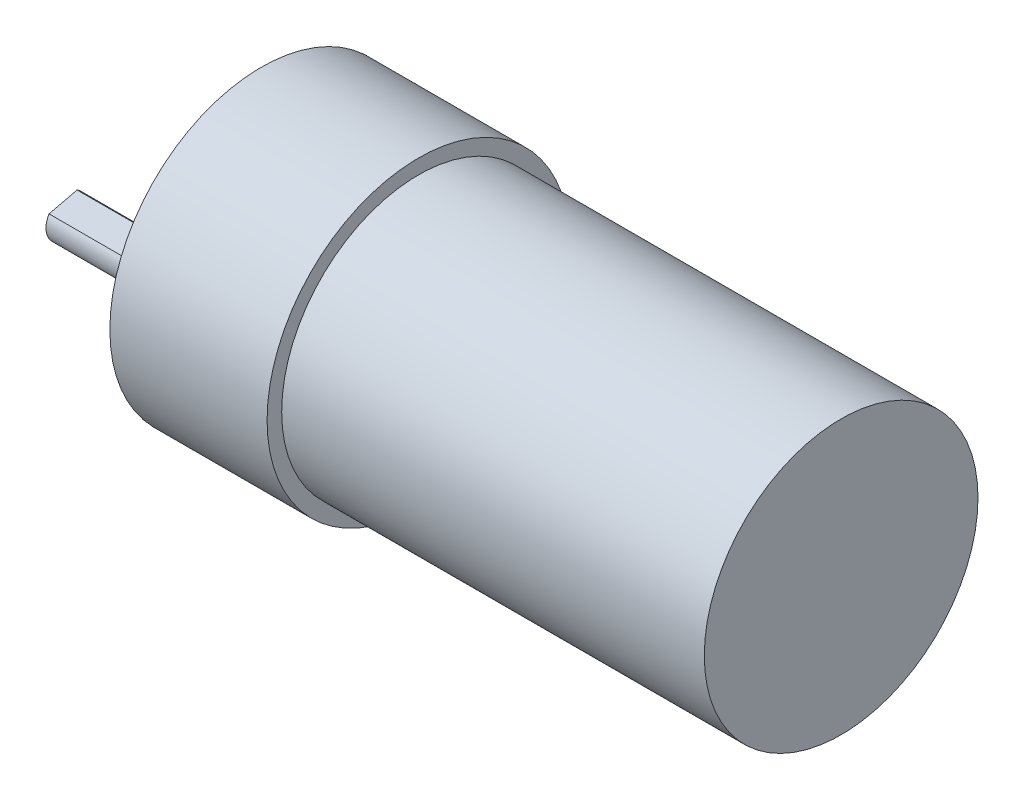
ISO-10303-21;
HEADER;
FILE_DESCRIPTION(('STEP AP214'),'2;1');
FILE_NAME('part.step','',(''),(''),'','','');
FILE_SCHEMA(('AUTOMOTIVE_DESIGN { 1 0 10303 214 1 1 1 1 }'));
ENDSEC;
DATA;
#1=APPLICATION_CONTEXT('core data for automotive mechanical design processes');
#2=APPLICATION_PROTOCOL_DEFINITION('international standard','automotive_design',2000,#1);
#3=PRODUCT_CONTEXT('',#1,'mechanical');
#4=PRODUCT('Part','Part','',(#3));
#5=PRODUCT_RELATED_PRODUCT_CATEGORY('part','',(#4));
#6=PRODUCT_DEFINITION_FORMATION('','',#4);
#7=PRODUCT_DEFINITION_CONTEXT('part definition',#1,'design');
#8=PRODUCT_DEFINITION('design','',#6,#7);
#9=PRODUCT_DEFINITION_SHAPE('','',#8);
#10=(LENGTH_UNIT() NAMED_UNIT(*) SI_UNIT(.MILLI.,.METRE.));
#11=(NAMED_UNIT(*) PLANE_ANGLE_UNIT() SI_UNIT($,.RADIAN.));
#12=(NAMED_UNIT(*) SI_UNIT($,.STERADIAN.) SOLID_ANGLE_UNIT());
#13=UNCERTAINTY_MEASURE_WITH_UNIT(LENGTH_MEASURE(1.E-05),#10,'distance_accuracy_value','');
#14=(GEOMETRIC_REPRESENTATION_CONTEXT(3) GLOBAL_UNCERTAINTY_ASSIGNED_CONTEXT((#13)) GLOBAL_UNIT_ASSIGNED_CONTEXT((#10,
#11,#12)) REPRESENTATION_CONTEXT('',''));
#15=CARTESIAN_POINT('',(0.,0.,0.));
#16=DIRECTION('',(0.,0.,1.));
#17=DIRECTION('',(1.,0.,0.));
#18=AXIS2_PLACEMENT_3D('',#15,#16,#17);
#19=CARTESIAN_POINT('',(-40.8432,-8.71855,0.));
#20=DIRECTION('',(1.,0.,0.));
#21=DIRECTION('',(0.,0.,-1.));
#22=AXIS2_PLACEMENT_3D('',#19,#20,#21);
#23=CYLINDRICAL_SURFACE('',#22,2.3749);
#24=CARTESIAN_POINT('',(-18.2372,-8.71855,0.));
#25=DIRECTION('',(-1.,0.,0.));
#26=DIRECTION('',(0.,0.,1.));
#27=AXIS2_PLACEMENT_3D('',#24,#25,#26);
#28=CIRCLE('',#27,2.3749);
#29=CARTESIAN_POINT('',(-18.2372,-8.71855,2.3749));
#30=VERTEX_POINT('',#29);
#31=EDGE_CURVE('E90',#30,#30,#28,.T.);
#32=ORIENTED_EDGE('',*,*,#31,.T.);
#33=EDGE_LOOP('',(#32));
#34=FACE_BOUND('',#33,.T.);
#35=DIRECTION('',(1.,0.,0.));
#36=VECTOR('',#35,1.);
#37=CARTESIAN_POINT('',(-40.8432,-6.68747817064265,-1.23081161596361));
#38=LINE('',#37,#36);
#39=CARTESIAN_POINT('',(-25.8572,-6.68747817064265,-1.23081161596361));
#40=VERTEX_POINT('',#39);
#41=CARTESIAN_POINT('',(-40.8432,-6.68747817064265,-1.23081161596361));
#42=VERTEX_POINT('',#41);
#43=EDGE_CURVE('E51',#40,#42,#38,.F.);
#44=ORIENTED_EDGE('',*,*,#43,.F.);
#45=CARTESIAN_POINT('',(-25.8572,-8.71855,0.));
#46=DIRECTION('',(1.,0.,0.));
#47=DIRECTION('',(0.,0.,-1.));
#48=AXIS2_PLACEMENT_3D('',#45,#46,#47);
#49=CIRCLE('',#48,2.3749);
#50=CARTESIAN_POINT('',(-25.8572,-7.46406700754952,2.01653723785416));
#51=VERTEX_POINT('',#50);
#52=EDGE_CURVE('E11',#40,#51,#49,.T.);
#53=ORIENTED_EDGE('',*,*,#52,.T.);
#54=DIRECTION('',(1.,0.,0.));
#55=VECTOR('',#54,1.);
#56=CARTESIAN_POINT('',(-40.8432,-7.46406700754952,2.01653723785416));
#57=LINE('',#56,#55);
#58=CARTESIAN_POINT('',(-40.8432,-7.46406700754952,2.01653723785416));
#59=VERTEX_POINT('',#58);
#60=EDGE_CURVE('E60',#59,#51,#57,.T.);
#61=ORIENTED_EDGE('',*,*,#60,.F.);
#62=CARTESIAN_POINT('',(-40.8432,-8.71855,0.));
#63=DIRECTION('',(-1.,0.,0.));
#64=DIRECTION('',(0.,0.,1.));
#65=AXIS2_PLACEMENT_3D('',#62,#63,#64);
#66=CIRCLE('',#65,2.3749);
#67=EDGE_CURVE('E72',#42,#59,#66,.T.);
#68=ORIENTED_EDGE('',*,*,#67,.F.);
#69=EDGE_LOOP('',(#44,#53,#61,#68));
#70=FACE_BOUND('',#69,.T.);
#71=ADVANCED_FACE('F36',(#34,#70),#23,.T.);
#72=CARTESIAN_POINT('',(-40.8432,-8.71855,0.));
#73=DIRECTION('',(-1.,0.,0.));
#74=DIRECTION('',(0.,0.,1.));
#75=AXIS2_PLACEMENT_3D('',#72,#73,#74);
#76=PLANE('',#75);
#77=ORIENTED_EDGE('',*,*,#67,.T.);
#78=DIRECTION('',(0.,0.232587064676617,-0.972575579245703));
#79=VECTOR('',#78,1.);
#80=CARTESIAN_POINT('',(-40.8432,-7.07577258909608,0.392862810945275));
#81=LINE('',#80,#79);
#82=EDGE_CURVE('E44',#59,#42,#81,.T.);
#83=ORIENTED_EDGE('',*,*,#82,.T.);
#84=EDGE_LOOP('',(#77,#83));
#85=FACE_BOUND('',#84,.T.);
#86=ADVANCED_FACE('F108',(#85),#76,.T.);
#87=CARTESIAN_POINT('',(-18.2372,0.,0.));
#88=DIRECTION('',(-1.,0.,0.));
#89=DIRECTION('',(0.,0.,1.));
#90=AXIS2_PLACEMENT_3D('',#87,#88,#89);
#91=PLANE('',#90);
#92=CARTESIAN_POINT('',(-18.2372,-8.71855,-10.2108));
#93=DIRECTION('',(-1.,0.,0.));
#94=DIRECTION('',(0.,0.,1.));
#95=AXIS2_PLACEMENT_3D('',#92,#93,#94);
#96=CIRCLE('',#95,1.27);
#97=CARTESIAN_POINT('',(-18.2372,-8.71855,-8.9408));
#98=VERTEX_POINT('',#97);
#99=EDGE_CURVE('E67',#98,#98,#96,.T.);
#100=ORIENTED_EDGE('',*,*,#99,.F.);
#101=EDGE_LOOP('',(#100));
#102=FACE_BOUND('',#101,.T.);
#103=CARTESIAN_POINT('',(-18.2372,-8.71855,10.2108));
#104=DIRECTION('',(-1.,0.,0.));
#105=DIRECTION('',(0.,0.,1.));
#106=AXIS2_PLACEMENT_3D('',#103,#104,#105);
#107=CIRCLE('',#106,1.27);
#108=CARTESIAN_POINT('',(-18.2372,-8.71855,11.4808));
#109=VERTEX_POINT('',#108);
#110=EDGE_CURVE('E78',#109,#109,#107,.T.);
#111=ORIENTED_EDGE('',*,*,#110,.F.);
#112=EDGE_LOOP('',(#111));
#113=FACE_BOUND('',#112,.T.);
#114=CARTESIAN_POINT('',(-18.2372,13.45565,0.));
#115=DIRECTION('',(-1.,0.,0.));
#116=DIRECTION('',(0.,0.,1.));
#117=AXIS2_PLACEMENT_3D('',#114,#115,#116);
#118=CIRCLE('',#117,1.27);
#119=CARTESIAN_POINT('',(-18.2372,13.45565,1.27));
#120=VERTEX_POINT('',#119);
#121=EDGE_CURVE('E84',#120,#120,#118,.T.);
#122=ORIENTED_EDGE('',*,*,#121,.F.);
#123=EDGE_LOOP('',(#122));
#124=FACE_BOUND('',#123,.T.);
#125=CARTESIAN_POINT('',(-18.2372,0.,0.));
#126=DIRECTION('',(-1.,0.,0.));
#127=DIRECTION('',(0.,0.,1.));
#128=AXIS2_PLACEMENT_3D('',#125,#126,#127);
#129=CIRCLE('',#128,17.56918);
#130=CARTESIAN_POINT('',(-18.2372,0.,17.56918));
#131=VERTEX_POINT('',#130);
#132=EDGE_CURVE('E97',#131,#131,#129,.T.);
#133=ORIENTED_EDGE('',*,*,#132,.T.);
#134=EDGE_LOOP('',(#133));
#135=FACE_BOUND('',#134,.T.);
#136=ORIENTED_EDGE('',*,*,#31,.F.);
#137=EDGE_LOOP('',(#136));
#138=FACE_BOUND('',#137,.T.);
#139=ADVANCED_FACE('F110',(#102,#113,#124,#135,#138),#91,.T.);
#140=CARTESIAN_POINT('',(49.022,0.,0.));
#141=DIRECTION('',(-1.,0.,0.));
#142=DIRECTION('',(0.,0.,1.));
#143=AXIS2_PLACEMENT_3D('',#140,#141,#142);
#144=CYLINDRICAL_SURFACE('',#143,15.875);
#145=CARTESIAN_POINT('',(49.022,0.,0.));
#146=DIRECTION('',(1.,0.,0.));
#147=DIRECTION('',(0.,0.,-1.));
#148=AXIS2_PLACEMENT_3D('',#145,#146,#147);
#149=CIRCLE('',#148,15.875);
#150=CARTESIAN_POINT('',(49.022,0.,-15.875));
#151=VERTEX_POINT('',#150);
#152=EDGE_CURVE('E105',#151,#151,#149,.T.);
#153=ORIENTED_EDGE('',*,*,#152,.F.);
#154=EDGE_LOOP('',(#153));
#155=FACE_BOUND('',#154,.T.);
#156=CARTESIAN_POINT('',(0.,0.,0.));
#157=DIRECTION('',(-1.,0.,0.));
#158=DIRECTION('',(0.,0.,1.));
#159=AXIS2_PLACEMENT_3D('',#156,#157,#158);
#160=CIRCLE('',#159,15.875);
#161=CARTESIAN_POINT('',(0.,0.,15.875));
#162=VERTEX_POINT('',#161);
#163=EDGE_CURVE('E100',#162,#162,#160,.T.);
#164=ORIENTED_EDGE('',*,*,#163,.F.);
#165=EDGE_LOOP('',(#164));
#166=FACE_BOUND('',#165,.T.);
#167=ADVANCED_FACE('F38',(#155,#166),#144,.T.);
#168=CARTESIAN_POINT('',(49.022,0.,0.));
#169=DIRECTION('',(1.,0.,0.));
#170=DIRECTION('',(0.,0.,-1.));
#171=AXIS2_PLACEMENT_3D('',#168,#169,#170);
#172=PLANE('',#171);
#173=ORIENTED_EDGE('',*,*,#152,.T.);
#174=EDGE_LOOP('',(#173));
#175=FACE_BOUND('',#174,.T.);
#176=ADVANCED_FACE('F128',(#175),#172,.T.);
#177=CARTESIAN_POINT('',(0.,0.,0.));
#178=DIRECTION('',(-1.,0.,0.));
#179=DIRECTION('',(0.,0.,1.));
#180=AXIS2_PLACEMENT_3D('',#177,#178,#179);
#181=PLANE('',#180);
#182=CARTESIAN_POINT('',(0.,0.,0.));
#183=DIRECTION('',(-1.,0.,0.));
#184=DIRECTION('',(0.,0.,1.));
#185=AXIS2_PLACEMENT_3D('',#182,#183,#184);
#186=CIRCLE('',#185,17.56918);
#187=CARTESIAN_POINT('',(0.,0.,17.56918));
#188=VERTEX_POINT('',#187);
#189=EDGE_CURVE('E94',#188,#188,#186,.T.);
#190=ORIENTED_EDGE('',*,*,#189,.F.);
#191=EDGE_LOOP('',(#190));
#192=FACE_BOUND('',#191,.T.);
#193=ORIENTED_EDGE('',*,*,#163,.T.);
#194=EDGE_LOOP('',(#193));
#195=FACE_BOUND('',#194,.T.);
#196=ADVANCED_FACE('F124',(#192,#195),#181,.F.);
#197=CARTESIAN_POINT('',(-18.2372,0.,0.));
#198=DIRECTION('',(1.,0.,0.));
#199=DIRECTION('',(0.,0.,-1.));
#200=AXIS2_PLACEMENT_3D('',#197,#198,#199);
#201=CYLINDRICAL_SURFACE('',#200,17.56918);
#202=ORIENTED_EDGE('',*,*,#132,.F.);
#203=EDGE_LOOP('',(#202));
#204=FACE_BOUND('',#203,.T.);
#205=ORIENTED_EDGE('',*,*,#189,.T.);
#206=EDGE_LOOP('',(#205));
#207=FACE_BOUND('',#206,.T.);
#208=ADVANCED_FACE('F127',(#204,#207),#201,.T.);
#209=CARTESIAN_POINT('',(-8.2372,13.45565,0.));
#210=DIRECTION('',(-1.,0.,0.));
#211=DIRECTION('',(0.,0.,1.));
#212=AXIS2_PLACEMENT_3D('',#209,#210,#211);
#213=CYLINDRICAL_SURFACE('',#212,1.27);
#214=CARTESIAN_POINT('',(-8.2372,13.45565,0.));
#215=DIRECTION('',(-1.,0.,0.));
#216=DIRECTION('',(0.,0.,1.));
#217=AXIS2_PLACEMENT_3D('',#214,#215,#216);
#218=CIRCLE('',#217,1.27);
#219=CARTESIAN_POINT('',(-8.2372,13.45565,1.27));
#220=VERTEX_POINT('',#219);
#221=EDGE_CURVE('E87',#220,#220,#218,.T.);
#222=ORIENTED_EDGE('',*,*,#221,.F.);
#223=EDGE_LOOP('',(#222));
#224=FACE_BOUND('',#223,.T.);
#225=ORIENTED_EDGE('',*,*,#121,.T.);
#226=EDGE_LOOP('',(#225));
#227=FACE_BOUND('',#226,.T.);
#228=ADVANCED_FACE('F121',(#224,#227),#213,.F.);
#229=CARTESIAN_POINT('',(-8.2372,13.45565,0.));
#230=DIRECTION('',(-1.,0.,0.));
#231=DIRECTION('',(0.,0.,1.));
#232=AXIS2_PLACEMENT_3D('',#229,#230,#231);
#233=PLANE('',#232);
#234=ORIENTED_EDGE('',*,*,#221,.T.);
#235=EDGE_LOOP('',(#234));
#236=FACE_BOUND('',#235,.T.);
#237=ADVANCED_FACE('F166',(#236),#233,.T.);
#238=CARTESIAN_POINT('',(-8.2372,-8.71855,10.2108));
#239=DIRECTION('',(-1.,0.,0.));
#240=DIRECTION('',(0.,0.,1.));
#241=AXIS2_PLACEMENT_3D('',#238,#239,#240);
#242=CYLINDRICAL_SURFACE('',#241,1.27);
#243=CARTESIAN_POINT('',(-8.2372,-8.71855,10.2108));
#244=DIRECTION('',(-1.,0.,0.));
#245=DIRECTION('',(0.,0.,1.));
#246=AXIS2_PLACEMENT_3D('',#243,#244,#245);
#247=CIRCLE('',#246,1.27);
#248=CARTESIAN_POINT('',(-8.2372,-8.71855,11.4808));
#249=VERTEX_POINT('',#248);
#250=EDGE_CURVE('E81',#249,#249,#247,.T.);
#251=ORIENTED_EDGE('',*,*,#250,.F.);
#252=EDGE_LOOP('',(#251));
#253=FACE_BOUND('',#252,.T.);
#254=ORIENTED_EDGE('',*,*,#110,.T.);
#255=EDGE_LOOP('',(#254));
#256=FACE_BOUND('',#255,.T.);
#257=ADVANCED_FACE('F172',(#253,#256),#242,.F.);
#258=CARTESIAN_POINT('',(-8.2372,-8.71855,10.2108));
#259=DIRECTION('',(-1.,0.,0.));
#260=DIRECTION('',(0.,0.,1.));
#261=AXIS2_PLACEMENT_3D('',#258,#259,#260);
#262=PLANE('',#261);
#263=ORIENTED_EDGE('',*,*,#250,.T.);
#264=EDGE_LOOP('',(#263));
#265=FACE_BOUND('',#264,.T.);
#266=ADVANCED_FACE('F178',(#265),#262,.T.);
#267=CARTESIAN_POINT('',(-8.2372,-8.71855,-10.2108));
#268=DIRECTION('',(-1.,0.,0.));
#269=DIRECTION('',(0.,0.,1.));
#270=AXIS2_PLACEMENT_3D('',#267,#268,#269);
#271=CYLINDRICAL_SURFACE('',#270,1.27);
#272=CARTESIAN_POINT('',(-8.2372,-8.71855,-10.2108));
#273=DIRECTION('',(-1.,0.,0.));
#274=DIRECTION('',(0.,0.,1.));
#275=AXIS2_PLACEMENT_3D('',#272,#273,#274);
#276=CIRCLE('',#275,1.27);
#277=CARTESIAN_POINT('',(-8.2372,-8.71855,-8.9408));
#278=VERTEX_POINT('',#277);
#279=EDGE_CURVE('E75',#278,#278,#276,.T.);
#280=ORIENTED_EDGE('',*,*,#279,.F.);
#281=EDGE_LOOP('',(#280));
#282=FACE_BOUND('',#281,.T.);
#283=ORIENTED_EDGE('',*,*,#99,.T.);
#284=EDGE_LOOP('',(#283));
#285=FACE_BOUND('',#284,.T.);
#286=ADVANCED_FACE('F186',(#282,#285),#271,.F.);
#287=CARTESIAN_POINT('',(-8.2372,-8.71855,-10.2108));
#288=DIRECTION('',(-1.,0.,0.));
#289=DIRECTION('',(0.,0.,1.));
#290=AXIS2_PLACEMENT_3D('',#287,#288,#289);
#291=PLANE('',#290);
#292=ORIENTED_EDGE('',*,*,#279,.T.);
#293=EDGE_LOOP('',(#292));
#294=FACE_BOUND('',#293,.T.);
#295=ADVANCED_FACE('F194',(#294),#291,.T.);
#296=CARTESIAN_POINT('',(-25.8572,-8.21958385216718,5.17577239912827));
#297=DIRECTION('',(1.,0.,0.));
#298=DIRECTION('',(0.,0.,-1.));
#299=AXIS2_PLACEMENT_3D('',#296,#297,#298);
#300=PLANE('',#299);
#301=DIRECTION('',(0.,0.232587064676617,-0.972575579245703));
#302=VECTOR('',#301,1.);
#303=CARTESIAN_POINT('',(-25.8572,-8.21958385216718,5.17577239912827));
#304=LINE('',#303,#302);
#305=EDGE_CURVE('E63',#51,#40,#304,.T.);
#306=ORIENTED_EDGE('',*,*,#305,.F.);
#307=ORIENTED_EDGE('',*,*,#52,.F.);
#308=EDGE_LOOP('',(#306,#307));
#309=FACE_BOUND('',#308,.T.);
#310=ADVANCED_FACE('F70',(#309),#300,.F.);
#311=CARTESIAN_POINT('',(-25.8572,-5.65789785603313,-5.5360582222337));
#312=DIRECTION('',(0.,0.972575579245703,0.232587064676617));
#313=DIRECTION('',(0.,-0.232587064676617,0.972575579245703));
#314=AXIS2_PLACEMENT_3D('',#311,#312,#313);
#315=PLANE('',#314);
#316=ORIENTED_EDGE('',*,*,#60,.T.);
#317=ORIENTED_EDGE('',*,*,#305,.T.);
#318=ORIENTED_EDGE('',*,*,#43,.T.);
#319=ORIENTED_EDGE('',*,*,#82,.F.);
#320=EDGE_LOOP('',(#316,#317,#318,#319));
#321=FACE_BOUND('',#320,.T.);
#322=ADVANCED_FACE('F62',(#321),#315,.T.);
#323=CLOSED_SHELL('',(#71,#86,#139,#167,#176,#196,#208,#228,#237,#257,#266,#286,#295,#310,#322));
#324=MANIFOLD_SOLID_BREP('B2',#323);
#325=ADVANCED_BREP_SHAPE_REPRESENTATION('',(#18,#324),#14);
#326=SHAPE_DEFINITION_REPRESENTATION(#9,#325);
ENDSEC;
END-ISO-10303-21;
